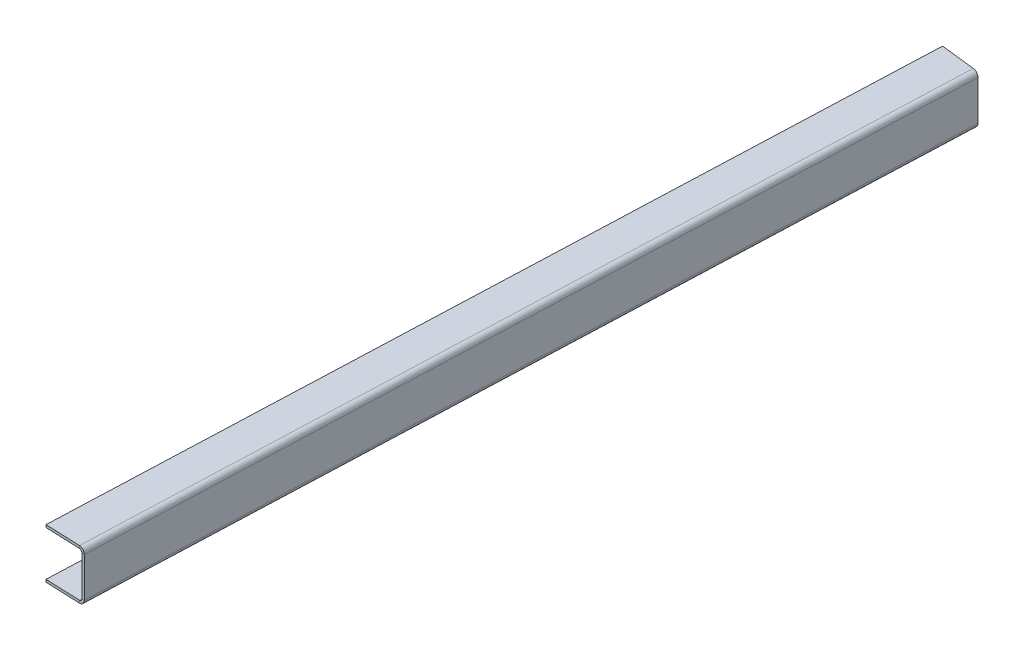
ISO-10303-21;
HEADER;
FILE_DESCRIPTION(('STEP AP214'),'2;1');
FILE_NAME('part.step','',(''),(''),'','','');
FILE_SCHEMA(('AUTOMOTIVE_DESIGN { 1 0 10303 214 1 1 1 1 }'));
ENDSEC;
DATA;
#1=APPLICATION_CONTEXT('core data for automotive mechanical design processes');
#2=APPLICATION_PROTOCOL_DEFINITION('international standard','automotive_design',2000,#1);
#3=PRODUCT_CONTEXT('',#1,'mechanical');
#4=PRODUCT('Part','Part','',(#3));
#5=PRODUCT_RELATED_PRODUCT_CATEGORY('part','',(#4));
#6=PRODUCT_DEFINITION_FORMATION('','',#4);
#7=PRODUCT_DEFINITION_CONTEXT('part definition',#1,'design');
#8=PRODUCT_DEFINITION('design','',#6,#7);
#9=PRODUCT_DEFINITION_SHAPE('','',#8);
#10=(LENGTH_UNIT() NAMED_UNIT(*) SI_UNIT(.MILLI.,.METRE.));
#11=(NAMED_UNIT(*) PLANE_ANGLE_UNIT() SI_UNIT($,.RADIAN.));
#12=(NAMED_UNIT(*) SI_UNIT($,.STERADIAN.) SOLID_ANGLE_UNIT());
#13=UNCERTAINTY_MEASURE_WITH_UNIT(LENGTH_MEASURE(1.E-05),#10,'distance_accuracy_value','');
#14=(GEOMETRIC_REPRESENTATION_CONTEXT(3) GLOBAL_UNCERTAINTY_ASSIGNED_CONTEXT((#13)) GLOBAL_UNIT_ASSIGNED_CONTEXT((#10,
#11,#12)) REPRESENTATION_CONTEXT('',''));
#15=CARTESIAN_POINT('',(0.,0.,0.));
#16=DIRECTION('',(0.,0.,1.));
#17=DIRECTION('',(1.,0.,0.));
#18=AXIS2_PLACEMENT_3D('',#15,#16,#17);
#19=CARTESIAN_POINT('',(-1086.66471952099,1.81488018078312E-13,-704.50466002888));
#20=DIRECTION('',(0.0392134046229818,0.,-0.999230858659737));
#21=DIRECTION('',(0.,1.,0.));
#22=AXIS2_PLACEMENT_3D('',#19,#20,#21);
#23=PLANE('',#22);
#24=DIRECTION('',(-0.999230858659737,0.,-0.0392134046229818));
#25=VECTOR('',#24,1.);
#26=CARTESIAN_POINT('',(-1086.66471952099,-28.4988000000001,-704.50466002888));
#27=LINE('',#26,#25);
#28=CARTESIAN_POINT('',(-1085.04036983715,-28.4988000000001,-704.440914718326));
#29=VERTEX_POINT('',#28);
#30=CARTESIAN_POINT('',(-1086.66471952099,-28.4988000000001,-704.50466002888));
#31=VERTEX_POINT('',#30);
#32=EDGE_CURVE('E12',#29,#31,#27,.T.);
#33=ORIENTED_EDGE('',*,*,#32,.F.);
#34=DIRECTION('',(0.,1.,0.));
#35=VECTOR('',#34,1.);
#36=CARTESIAN_POINT('',(-1085.04036983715,1.81162777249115E-13,-704.440914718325));
#37=LINE('',#36,#35);
#38=CARTESIAN_POINT('',(-1085.04036983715,-3.25120000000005,-704.440914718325));
#39=VERTEX_POINT('',#38);
#40=EDGE_CURVE('E137',#29,#39,#37,.T.);
#41=ORIENTED_EDGE('',*,*,#40,.T.);
#42=DIRECTION('',(-0.999230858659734,0.,-0.0392134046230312));
#43=VECTOR('',#42,1.);
#44=CARTESIAN_POINT('',(-1086.66471952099,-3.25120000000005,-704.50466002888));
#45=LINE('',#44,#43);
#46=CARTESIAN_POINT('',(-1086.66471952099,-3.25120000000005,-704.50466002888));
#47=VERTEX_POINT('',#46);
#48=EDGE_CURVE('E90',#39,#47,#45,.T.);
#49=ORIENTED_EDGE('',*,*,#48,.T.);
#50=DIRECTION('',(0.,1.,0.));
#51=VECTOR('',#50,1.);
#52=CARTESIAN_POINT('',(-1086.66471952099,1.81488018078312E-13,-704.50466002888));
#53=LINE('',#52,#51);
#54=EDGE_CURVE('E139',#31,#47,#53,.T.);
#55=ORIENTED_EDGE('',*,*,#54,.F.);
#56=EDGE_LOOP('',(#33,#41,#49,#55));
#57=FACE_BOUND('',#56,.T.);
#58=ADVANCED_FACE('F78',(#57),#23,.F.);
#59=CARTESIAN_POINT('',(-1089.91334775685,-3.25120000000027,-704.63396322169));
#60=CARTESIAN_POINT('',(-1090.45479765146,-3.25120000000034,-704.655211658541));
#61=CARTESIAN_POINT('',(-1090.99624754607,-3.25120000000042,-704.676460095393));
#62=CARTESIAN_POINT('',(-1091.53769744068,-3.25120000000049,-704.697708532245));
#63=CARTESIAN_POINT('',(-1089.91334775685,-6.50240000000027,-704.63396322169));
#64=CARTESIAN_POINT('',(-1090.45479765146,-7.58613333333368,-704.655211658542));
#65=CARTESIAN_POINT('',(-1090.99624754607,-8.66986666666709,-704.676460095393));
#66=CARTESIAN_POINT('',(-1091.53769744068,-9.75360000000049,-704.697708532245));
#67=CARTESIAN_POINT('',(-1086.66471952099,-6.50239999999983,-704.50466002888));
#68=CARTESIAN_POINT('',(-1086.12326962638,-7.58613333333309,-704.483411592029));
#69=CARTESIAN_POINT('',(-1085.58181973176,-8.66986666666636,-704.462163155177));
#70=CARTESIAN_POINT('',(-1085.04036983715,-9.75359999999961,-704.440914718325));
#71=CARTESIAN_POINT('',(-1086.66471952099,-3.25119999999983,-704.50466002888));
#72=CARTESIAN_POINT('',(-1086.12326962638,-3.25119999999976,-704.483411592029));
#73=CARTESIAN_POINT('',(-1085.58181973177,-3.25119999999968,-704.462163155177));
#74=CARTESIAN_POINT('',(-1085.04036983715,-3.25119999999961,-704.440914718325));
#75=CARTESIAN_POINT('',(-1086.66471952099,1.69569219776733E-13,-704.50466002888));
#76=CARTESIAN_POINT('',(-1086.12326962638,1.08373333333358,-704.483411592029));
#77=CARTESIAN_POINT('',(-1085.58181973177,2.16746666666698,-704.462163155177));
#78=CARTESIAN_POINT('',(-1085.04036983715,3.25120000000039,-704.440914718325));
#79=CARTESIAN_POINT('',(-1089.91334775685,-2.70183181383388E-13,-704.63396322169));
#80=CARTESIAN_POINT('',(-1090.45479765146,1.08373333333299,-704.655211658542));
#81=CARTESIAN_POINT('',(-1090.99624754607,2.16746666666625,-704.676460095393));
#82=CARTESIAN_POINT('',(-1091.53769744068,3.25119999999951,-704.697708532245));
#83=CARTESIAN_POINT('',(-1089.91334775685,-3.25120000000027,-704.63396322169));
#84=CARTESIAN_POINT('',(-1090.45479765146,-3.25120000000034,-704.655211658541));
#85=CARTESIAN_POINT('',(-1090.99624754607,-3.25120000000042,-704.676460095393));
#86=CARTESIAN_POINT('',(-1091.53769744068,-3.25120000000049,-704.697708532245));
#87=(BOUNDED_SURFACE() B_SPLINE_SURFACE(3,3,((#59,#60,#61,#62),(#63,#64,#65,#66),(#67,#68,#69,
#70),(#71,#72,#73,#74),(#75,#76,#77,#78),(#79,#80,#81,#82),(#83,#84,#85,#86)),.UNSPECIFIED.,.T.,
.F.,.F.) B_SPLINE_SURFACE_WITH_KNOTS((4,3,4),(4,4),(0.,0.5,1.),(0.,1.),
.UNSPECIFIED.) GEOMETRIC_REPRESENTATION_ITEM() RATIONAL_B_SPLINE_SURFACE(((1.,1.,1.,1.),
(0.333333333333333,0.333333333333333,0.333333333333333,0.333333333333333),(0.333333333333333,
0.333333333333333,0.333333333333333,0.333333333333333),(1.,1.,1.,1.),(0.333333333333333,
0.333333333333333,0.333333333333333,0.333333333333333),(0.333333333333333,0.333333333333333,
0.333333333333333,0.333333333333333),(1.,1.,1.,1.))) REPRESENTATION_ITEM('') SURFACE());
#88=CARTESIAN_POINT('',(-1088.28903363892,-3.25120000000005,-704.569311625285));
#89=DIRECTION('',(-0.0394921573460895,0.,0.999219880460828));
#90=DIRECTION('',(-0.999219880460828,-1.35258484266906E-13,-0.0394921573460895));
#91=AXIS2_PLACEMENT_3D('',#88,#89,#90);
#92=ELLIPSE('',#91,3.25120012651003,3.2512);
#93=CARTESIAN_POINT('',(-1088.28903363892,0.,-704.569311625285));
#94=VERTEX_POINT('',#93);
#95=EDGE_CURVE('E215',#39,#94,#92,.T.);
#96=DIRECTION('',(0.,-1.,0.));
#97=VECTOR('',#96,1.);
#98=CARTESIAN_POINT('',(-1088.28903363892,-1.62560000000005,-704.569311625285));
#99=LINE('',#98,#97);
#100=CARTESIAN_POINT('',(-1088.28903363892,-1.62560000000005,-704.569311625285));
#101=VERTEX_POINT('',#100);
#102=EDGE_CURVE('E205',#94,#101,#99,.T.);
#103=CARTESIAN_POINT('',(-1088.28903363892,-3.25120000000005,-704.569311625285));
#104=DIRECTION('',(-0.0397709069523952,0.,0.999208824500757));
#105=DIRECTION('',(-0.999208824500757,-1.35321803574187E-13,-0.0397709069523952));
#106=AXIS2_PLACEMENT_3D('',#103,#104,#105);
#107=ELLIPSE('',#106,1.62560025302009,1.6256);
#108=EDGE_CURVE('E213',#47,#101,#107,.T.);
#109=ORIENTED_EDGE('',*,*,#48,.F.);
#110=ORIENTED_EDGE('',*,*,#95,.T.);
#111=ORIENTED_EDGE('',*,*,#102,.T.);
#112=ORIENTED_EDGE('',*,*,#108,.F.);
#113=EDGE_LOOP('',(#109,#110,#111,#112));
#114=FACE_BOUND('',#113,.T.);
#115=ADVANCED_FACE('F212',(#114),#87,.F.);
#116=CARTESIAN_POINT('',(-1110.42470415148,-1.62560000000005,-705.450364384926));
#117=DIRECTION('',(-0.0397709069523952,0.,0.999208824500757));
#118=DIRECTION('',(0.999208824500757,0.,0.0397709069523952));
#119=AXIS2_PLACEMENT_3D('',#116,#117,#118);
#120=PLANE('',#119);
#121=ORIENTED_EDGE('',*,*,#102,.F.);
#122=DIRECTION('',(0.999208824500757,0.,0.0397709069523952));
#123=VECTOR('',#122,1.);
#124=CARTESIAN_POINT('',(-1110.42470415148,0.,-705.450364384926));
#125=LINE('',#124,#123);
#126=CARTESIAN_POINT('',(-1110.42470415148,0.,-705.450364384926));
#127=VERTEX_POINT('',#126);
#128=EDGE_CURVE('E176',#127,#94,#125,.T.);
#129=ORIENTED_EDGE('',*,*,#128,.F.);
#130=DIRECTION('',(0.,-1.,0.));
#131=VECTOR('',#130,1.);
#132=CARTESIAN_POINT('',(-1110.42470415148,-1.62560000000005,-705.450364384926));
#133=LINE('',#132,#131);
#134=CARTESIAN_POINT('',(-1110.42470415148,-1.62560000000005,-705.450364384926));
#135=VERTEX_POINT('',#134);
#136=EDGE_CURVE('E202',#127,#135,#133,.T.);
#137=ORIENTED_EDGE('',*,*,#136,.T.);
#138=DIRECTION('',(0.999208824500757,0.,0.0397709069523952));
#139=VECTOR('',#138,1.);
#140=CARTESIAN_POINT('',(-1110.42470415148,-1.62560000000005,-705.450364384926));
#141=LINE('',#140,#139);
#142=EDGE_CURVE('E232',#135,#101,#141,.T.);
#143=ORIENTED_EDGE('',*,*,#142,.T.);
#144=EDGE_LOOP('',(#121,#129,#137,#143));
#145=FACE_BOUND('',#144,.T.);
#146=ADVANCED_FACE('F233',(#145),#120,.T.);
#147=CARTESIAN_POINT('',(-1088.88483177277,-1.62560000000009,-1254.32658105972));
#148=DIRECTION('',(-0.999230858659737,0.,-0.0392134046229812));
#149=DIRECTION('',(-0.0392134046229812,0.,0.999230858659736));
#150=AXIS2_PLACEMENT_3D('',#147,#148,#149);
#151=PLANE('',#150);
#152=ORIENTED_EDGE('',*,*,#136,.F.);
#153=DIRECTION('',(-0.0392134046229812,0.,0.999230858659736));
#154=VECTOR('',#153,1.);
#155=CARTESIAN_POINT('',(-1088.88483177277,0.,-1254.32658105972));
#156=LINE('',#155,#154);
#157=CARTESIAN_POINT('',(-1088.88483177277,0.,-1254.32658105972));
#158=VERTEX_POINT('',#157);
#159=EDGE_CURVE('E168',#158,#127,#156,.T.);
#160=ORIENTED_EDGE('',*,*,#159,.F.);
#161=DIRECTION('',(0.,-1.,0.));
#162=VECTOR('',#161,1.);
#163=CARTESIAN_POINT('',(-1088.88483177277,-1.62560000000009,-1254.32658105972));
#164=LINE('',#163,#162);
#165=CARTESIAN_POINT('',(-1088.88483177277,-1.62560000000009,-1254.32658105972));
#166=VERTEX_POINT('',#165);
#167=EDGE_CURVE('E199',#158,#166,#164,.T.);
#168=ORIENTED_EDGE('',*,*,#167,.T.);
#169=DIRECTION('',(-0.0392134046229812,0.,0.999230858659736));
#170=VECTOR('',#169,1.);
#171=CARTESIAN_POINT('',(-1088.88483177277,-1.62560000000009,-1254.32658105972));
#172=LINE('',#171,#170);
#173=EDGE_CURVE('E237',#166,#135,#172,.T.);
#174=ORIENTED_EDGE('',*,*,#173,.T.);
#175=EDGE_LOOP('',(#152,#160,#168,#174));
#176=FACE_BOUND('',#175,.T.);
#177=ADVANCED_FACE('F280',(#176),#151,.T.);
#178=CARTESIAN_POINT('',(-1063.57775084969,-1.62560000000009,-1251.46062743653));
#179=DIRECTION('',(0.112527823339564,0.,-0.993648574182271));
#180=DIRECTION('',(-0.993648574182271,0.,-0.112527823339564));
#181=AXIS2_PLACEMENT_3D('',#178,#179,#180);
#182=PLANE('',#181);
#183=ORIENTED_EDGE('',*,*,#167,.F.);
#184=DIRECTION('',(-0.993648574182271,0.,-0.112527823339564));
#185=VECTOR('',#184,1.);
#186=CARTESIAN_POINT('',(-1063.57775084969,0.,-1251.46062743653));
#187=LINE('',#186,#185);
#188=CARTESIAN_POINT('',(-1066.81267915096,0.,-1251.82697369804));
#189=VERTEX_POINT('',#188);
#190=EDGE_CURVE('E173',#189,#158,#187,.T.);
#191=ORIENTED_EDGE('',*,*,#190,.F.);
#192=DIRECTION('',(1.0244429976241E-13,-1.,0.));
#193=VECTOR('',#192,1.);
#194=CARTESIAN_POINT('',(-1066.81267915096,-1.62560000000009,-1251.82697369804));
#195=LINE('',#194,#193);
#196=CARTESIAN_POINT('',(-1066.81267915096,-1.62560000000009,-1251.82697369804));
#197=VERTEX_POINT('',#196);
#198=EDGE_CURVE('E196',#189,#197,#195,.T.);
#199=ORIENTED_EDGE('',*,*,#198,.T.);
#200=DIRECTION('',(-0.993648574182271,0.,-0.112527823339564));
#201=VECTOR('',#200,1.);
#202=CARTESIAN_POINT('',(-1063.57775084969,-1.62560000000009,-1251.46062743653));
#203=LINE('',#202,#201);
#204=EDGE_CURVE('E238',#197,#166,#203,.T.);
#205=ORIENTED_EDGE('',*,*,#204,.T.);
#206=EDGE_LOOP('',(#183,#191,#199,#205));
#207=FACE_BOUND('',#206,.T.);
#208=ADVANCED_FACE('F307',(#207),#182,.T.);
#209=CARTESIAN_POINT('',(-1068.43233233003,-3.25120000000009,-1252.01039472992));
#210=CARTESIAN_POINT('',(-1068.97378222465,-3.25120000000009,-1252.03164316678));
#211=CARTESIAN_POINT('',(-1069.51523211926,-3.25120000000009,-1252.05289160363));
#212=CARTESIAN_POINT('',(-1070.05668201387,-3.25120000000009,-1252.07414004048));
#213=CARTESIAN_POINT('',(-1068.43233233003,0.,-1252.01039472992));
#214=CARTESIAN_POINT('',(-1068.97378222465,1.08373333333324,-1252.03164316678));
#215=CARTESIAN_POINT('',(-1069.51523211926,2.16746666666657,-1252.05289160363));
#216=CARTESIAN_POINT('',(-1070.05668201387,3.25119999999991,-1252.07414004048));
#217=CARTESIAN_POINT('',(-1065.19302597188,0.,-1251.64355266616));
#218=CARTESIAN_POINT('',(-1064.65157607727,1.08373333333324,-1251.6223042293));
#219=CARTESIAN_POINT('',(-1064.11012618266,2.16746666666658,-1251.60105579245));
#220=CARTESIAN_POINT('',(-1063.56867628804,3.25119999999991,-1251.5798073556));
#221=CARTESIAN_POINT('',(-1065.19302597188,-3.25120000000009,-1251.64355266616));
#222=CARTESIAN_POINT('',(-1064.65157607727,-3.25120000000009,-1251.6223042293));
#223=CARTESIAN_POINT('',(-1064.11012618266,-3.25120000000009,-1251.60105579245));
#224=CARTESIAN_POINT('',(-1063.56867628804,-3.25120000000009,-1251.5798073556));
#225=CARTESIAN_POINT('',(-1065.19302597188,-6.50240000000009,-1251.64355266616));
#226=CARTESIAN_POINT('',(-1064.65157607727,-7.58613333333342,-1251.6223042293));
#227=CARTESIAN_POINT('',(-1064.11012618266,-8.66986666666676,-1251.60105579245));
#228=CARTESIAN_POINT('',(-1063.56867628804,-9.75360000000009,-1251.5798073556));
#229=CARTESIAN_POINT('',(-1068.43233233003,-6.50240000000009,-1252.01039472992));
#230=CARTESIAN_POINT('',(-1068.97378222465,-7.58613333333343,-1252.03164316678));
#231=CARTESIAN_POINT('',(-1069.51523211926,-8.66986666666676,-1252.05289160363));
#232=CARTESIAN_POINT('',(-1070.05668201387,-9.75360000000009,-1252.07414004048));
#233=CARTESIAN_POINT('',(-1068.43233233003,-3.25120000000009,-1252.01039472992));
#234=CARTESIAN_POINT('',(-1068.97378222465,-3.25120000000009,-1252.03164316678));
#235=CARTESIAN_POINT('',(-1069.51523211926,-3.25120000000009,-1252.05289160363));
#236=CARTESIAN_POINT('',(-1070.05668201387,-3.25120000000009,-1252.07414004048));
#237=(BOUNDED_SURFACE() B_SPLINE_SURFACE(3,3,((#209,#210,#211,#212),(#213,#214,#215,#216),(#217,
#218,#219,#220),(#221,#222,#223,#224),(#225,#226,#227,#228),(#229,#230,#231,#232),(#233,#234,
#235,#236)),.UNSPECIFIED.,.T.,.F.,.F.) B_SPLINE_SURFACE_WITH_KNOTS((4,3,4),(4,4),(0.,0.5,1.),
(0.,1.),.UNSPECIFIED.) GEOMETRIC_REPRESENTATION_ITEM() RATIONAL_B_SPLINE_SURFACE(((1.,1.,1.,1.),
(0.333333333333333,0.333333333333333,0.333333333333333,0.333333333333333),(0.333333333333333,
0.333333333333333,0.333333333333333,0.333333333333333),(1.,1.,1.,1.),(0.333333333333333,
0.333333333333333,0.333333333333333,0.333333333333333),(0.333333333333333,0.333333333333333,
0.333333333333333,0.333333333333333),(1.,1.,1.,1.))) REPRESENTATION_ITEM('') SURFACE());
#238=CARTESIAN_POINT('',(-1066.81267915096,-3.25120000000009,-1251.82697369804));
#239=DIRECTION('',(0.075971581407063,0.,-0.997109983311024));
#240=DIRECTION('',(-0.997109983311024,0.,-0.075971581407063));
#241=AXIS2_PLACEMENT_3D('',#238,#239,#240);
#242=ELLIPSE('',#241,3.2534052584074,3.2512);
#243=CARTESIAN_POINT('',(-1063.56867628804,-3.25120000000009,-1251.5798073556));
#244=VERTEX_POINT('',#243);
#245=EDGE_CURVE('E178',#189,#244,#242,.T.);
#246=DIRECTION('',(-0.999230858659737,0.,-0.0392134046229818));
#247=VECTOR('',#246,1.);
#248=CARTESIAN_POINT('',(-1065.19302597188,-3.25120000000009,-1251.64355266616));
#249=LINE('',#248,#247);
#250=CARTESIAN_POINT('',(-1065.19302597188,-3.25120000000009,-1251.64355266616));
#251=VERTEX_POINT('',#250);
#252=EDGE_CURVE('E194',#244,#251,#249,.T.);
#253=CARTESIAN_POINT('',(-1066.81267915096,-3.25120000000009,-1251.82697369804));
#254=DIRECTION('',(0.112527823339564,0.,-0.993648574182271));
#255=DIRECTION('',(-0.993648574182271,0.,-0.112527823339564));
#256=AXIS2_PLACEMENT_3D('',#253,#254,#255);
#257=ELLIPSE('',#256,1.63000604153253,1.6256);
#258=EDGE_CURVE('E229',#197,#251,#257,.T.);
#259=ORIENTED_EDGE('',*,*,#198,.F.);
#260=ORIENTED_EDGE('',*,*,#245,.T.);
#261=ORIENTED_EDGE('',*,*,#252,.T.);
#262=ORIENTED_EDGE('',*,*,#258,.F.);
#263=EDGE_LOOP('',(#259,#260,#261,#262));
#264=FACE_BOUND('',#263,.T.);
#265=ADVANCED_FACE('F357',(#264),#237,.F.);
#266=CARTESIAN_POINT('',(-1065.19302597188,1.96636371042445E-13,-1251.64355266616));
#267=DIRECTION('',(-0.0392134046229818,0.,0.999230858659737));
#268=DIRECTION('',(0.,-1.,0.));
#269=AXIS2_PLACEMENT_3D('',#266,#267,#268);
#270=PLANE('',#269);
#271=ORIENTED_EDGE('',*,*,#252,.F.);
#272=DIRECTION('',(0.,1.,0.));
#273=VECTOR('',#272,1.);
#274=CARTESIAN_POINT('',(-1063.56867628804,1.81162777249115E-13,-1251.5798073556));
#275=LINE('',#274,#273);
#276=CARTESIAN_POINT('',(-1063.56867628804,-28.4988000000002,-1251.5798073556));
#277=VERTEX_POINT('',#276);
#278=EDGE_CURVE('E167',#244,#277,#275,.F.);
#279=ORIENTED_EDGE('',*,*,#278,.T.);
#280=DIRECTION('',(-0.999230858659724,0.,-0.0392134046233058));
#281=VECTOR('',#280,1.);
#282=CARTESIAN_POINT('',(-1065.19302597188,-28.4988000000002,-1251.64355266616));
#283=LINE('',#282,#281);
#284=CARTESIAN_POINT('',(-1065.19302597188,-28.4988000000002,-1251.64355266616));
#285=VERTEX_POINT('',#284);
#286=EDGE_CURVE('E191',#277,#285,#283,.T.);
#287=ORIENTED_EDGE('',*,*,#286,.T.);
#288=DIRECTION('',(0.,-1.,0.));
#289=VECTOR('',#288,1.);
#290=CARTESIAN_POINT('',(-1065.19302597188,1.96636371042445E-13,-1251.64355266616));
#291=LINE('',#290,#289);
#292=EDGE_CURVE('E284',#251,#285,#291,.T.);
#293=ORIENTED_EDGE('',*,*,#292,.F.);
#294=EDGE_LOOP('',(#271,#279,#287,#293));
#295=FACE_BOUND('',#294,.T.);
#296=ADVANCED_FACE('F322',(#295),#270,.F.);
#297=CARTESIAN_POINT('',(-1065.19302597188,-28.4988000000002,-1251.64355266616));
#298=CARTESIAN_POINT('',(-1064.65157607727,-28.4988000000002,-1251.6223042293));
#299=CARTESIAN_POINT('',(-1064.11012618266,-28.4988000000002,-1251.60105579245));
#300=CARTESIAN_POINT('',(-1063.56867628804,-28.4988000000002,-1251.5798073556));
#301=CARTESIAN_POINT('',(-1065.19302597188,-31.7500000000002,-1251.64355266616));
#302=CARTESIAN_POINT('',(-1064.65157607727,-32.8337333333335,-1251.6223042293));
#303=CARTESIAN_POINT('',(-1064.11012618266,-33.9174666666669,-1251.60105579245));
#304=CARTESIAN_POINT('',(-1063.56867628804,-35.0012000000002,-1251.5798073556));
#305=CARTESIAN_POINT('',(-1068.43233233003,-31.7500000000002,-1252.01039472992));
#306=CARTESIAN_POINT('',(-1068.97378222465,-32.8337333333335,-1252.03164316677));
#307=CARTESIAN_POINT('',(-1069.51523211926,-33.9174666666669,-1252.05289160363));
#308=CARTESIAN_POINT('',(-1070.05668201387,-35.0012000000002,-1252.07414004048));
#309=CARTESIAN_POINT('',(-1068.43233233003,-28.4988000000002,-1252.01039472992));
#310=CARTESIAN_POINT('',(-1068.97378222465,-28.4988000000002,-1252.03164316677));
#311=CARTESIAN_POINT('',(-1069.51523211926,-28.4988000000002,-1252.05289160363));
#312=CARTESIAN_POINT('',(-1070.05668201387,-28.4988000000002,-1252.07414004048));
#313=CARTESIAN_POINT('',(-1068.43233233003,-25.2476000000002,-1252.01039472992));
#314=CARTESIAN_POINT('',(-1068.97378222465,-24.1638666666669,-1252.03164316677));
#315=CARTESIAN_POINT('',(-1069.51523211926,-23.0801333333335,-1252.05289160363));
#316=CARTESIAN_POINT('',(-1070.05668201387,-21.9964000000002,-1252.07414004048));
#317=CARTESIAN_POINT('',(-1065.19302597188,-25.2476000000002,-1251.64355266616));
#318=CARTESIAN_POINT('',(-1064.65157607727,-24.1638666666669,-1251.6223042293));
#319=CARTESIAN_POINT('',(-1064.11012618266,-23.0801333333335,-1251.60105579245));
#320=CARTESIAN_POINT('',(-1063.56867628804,-21.9964000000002,-1251.5798073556));
#321=CARTESIAN_POINT('',(-1065.19302597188,-28.4988000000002,-1251.64355266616));
#322=CARTESIAN_POINT('',(-1064.65157607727,-28.4988000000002,-1251.6223042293));
#323=CARTESIAN_POINT('',(-1064.11012618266,-28.4988000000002,-1251.60105579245));
#324=CARTESIAN_POINT('',(-1063.56867628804,-28.4988000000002,-1251.5798073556));
#325=(BOUNDED_SURFACE() B_SPLINE_SURFACE(3,3,((#297,#298,#299,#300),(#301,#302,#303,#304),(#305,
#306,#307,#308),(#309,#310,#311,#312),(#313,#314,#315,#316),(#317,#318,#319,#320),(#321,#322,
#323,#324)),.UNSPECIFIED.,.T.,.F.,.F.) B_SPLINE_SURFACE_WITH_KNOTS((4,3,4),(4,4),(0.,0.5,1.),
(0.,1.),.UNSPECIFIED.) GEOMETRIC_REPRESENTATION_ITEM() RATIONAL_B_SPLINE_SURFACE(((1.,1.,1.,1.),
(0.333333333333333,0.333333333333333,0.333333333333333,0.333333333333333),(0.333333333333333,
0.333333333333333,0.333333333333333,0.333333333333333),(1.,1.,1.,1.),(0.333333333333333,
0.333333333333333,0.333333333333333,0.333333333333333),(0.333333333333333,0.333333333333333,
0.333333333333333,0.333333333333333),(1.,1.,1.,1.))) REPRESENTATION_ITEM('') SURFACE());
#326=CARTESIAN_POINT('',(-1066.81267915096,-28.4988000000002,-1251.82697369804));
#327=DIRECTION('',(0.0759715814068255,0.,-0.997109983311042));
#328=DIRECTION('',(0.997109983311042,0.,0.0759715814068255));
#329=AXIS2_PLACEMENT_3D('',#326,#327,#328);
#330=ELLIPSE('',#329,3.25340525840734,3.2512);
#331=CARTESIAN_POINT('',(-1066.81267915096,-31.7500000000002,-1251.82697369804));
#332=VERTEX_POINT('',#331);
#333=EDGE_CURVE('E155',#277,#332,#330,.T.);
#334=DIRECTION('',(0.,1.,0.));
#335=VECTOR('',#334,1.);
#336=CARTESIAN_POINT('',(-1066.81267915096,-30.1244000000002,-1251.82697369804));
#337=LINE('',#336,#335);
#338=CARTESIAN_POINT('',(-1066.81267915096,-30.1244000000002,-1251.82697369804));
#339=VERTEX_POINT('',#338);
#340=EDGE_CURVE('E188',#332,#339,#337,.T.);
#341=CARTESIAN_POINT('',(-1066.81267915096,-28.4988000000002,-1251.82697369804));
#342=DIRECTION('',(0.112527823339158,0.,-0.993648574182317));
#343=DIRECTION('',(0.993648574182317,0.,0.112527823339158));
#344=AXIS2_PLACEMENT_3D('',#341,#342,#343);
#345=ELLIPSE('',#344,1.63000604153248,1.6256);
#346=EDGE_CURVE('E254',#285,#339,#345,.T.);
#347=ORIENTED_EDGE('',*,*,#286,.F.);
#348=ORIENTED_EDGE('',*,*,#333,.T.);
#349=ORIENTED_EDGE('',*,*,#340,.T.);
#350=ORIENTED_EDGE('',*,*,#346,.F.);
#351=EDGE_LOOP('',(#347,#348,#349,#350));
#352=FACE_BOUND('',#351,.T.);
#353=ADVANCED_FACE('F326',(#352),#325,.F.);
#354=CARTESIAN_POINT('',(-1088.88483177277,-30.1244000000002,-1254.32658105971));
#355=DIRECTION('',(0.112527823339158,0.,-0.993648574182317));
#356=DIRECTION('',(0.993648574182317,0.,0.112527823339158));
#357=AXIS2_PLACEMENT_3D('',#354,#355,#356);
#358=PLANE('',#357);
#359=ORIENTED_EDGE('',*,*,#340,.F.);
#360=DIRECTION('',(0.993648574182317,0.,0.112527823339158));
#361=VECTOR('',#360,1.);
#362=CARTESIAN_POINT('',(-1088.88483177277,-31.7500000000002,-1254.32658105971));
#363=LINE('',#362,#361);
#364=CARTESIAN_POINT('',(-1088.88483177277,-31.7500000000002,-1254.32658105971));
#365=VERTEX_POINT('',#364);
#366=EDGE_CURVE('E262',#365,#332,#363,.T.);
#367=ORIENTED_EDGE('',*,*,#366,.F.);
#368=DIRECTION('',(0.,1.,0.));
#369=VECTOR('',#368,1.);
#370=CARTESIAN_POINT('',(-1088.88483177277,-30.1244000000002,-1254.32658105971));
#371=LINE('',#370,#369);
#372=CARTESIAN_POINT('',(-1088.88483177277,-30.1244000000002,-1254.32658105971));
#373=VERTEX_POINT('',#372);
#374=EDGE_CURVE('E185',#365,#373,#371,.T.);
#375=ORIENTED_EDGE('',*,*,#374,.T.);
#376=DIRECTION('',(0.993648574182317,0.,0.112527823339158));
#377=VECTOR('',#376,1.);
#378=CARTESIAN_POINT('',(-1088.88483177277,-30.1244000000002,-1254.32658105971));
#379=LINE('',#378,#377);
#380=EDGE_CURVE('E293',#373,#339,#379,.T.);
#381=ORIENTED_EDGE('',*,*,#380,.T.);
#382=EDGE_LOOP('',(#359,#367,#375,#381));
#383=FACE_BOUND('',#382,.T.);
#384=ADVANCED_FACE('F374',(#383),#358,.T.);
#385=CARTESIAN_POINT('',(-1110.42470415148,-30.1244000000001,-705.450364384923));
#386=DIRECTION('',(-0.999230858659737,0.,-0.0392134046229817));
#387=DIRECTION('',(0.0392134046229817,0.,-0.999230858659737));
#388=AXIS2_PLACEMENT_3D('',#385,#386,#387);
#389=PLANE('',#388);
#390=ORIENTED_EDGE('',*,*,#374,.F.);
#391=DIRECTION('',(0.0392134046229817,0.,-0.999230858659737));
#392=VECTOR('',#391,1.);
#393=CARTESIAN_POINT('',(-1110.42470415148,-31.7500000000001,-705.450364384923));
#394=LINE('',#393,#392);
#395=CARTESIAN_POINT('',(-1110.42470415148,-31.7500000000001,-705.450364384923));
#396=VERTEX_POINT('',#395);
#397=EDGE_CURVE('E255',#396,#365,#394,.T.);
#398=ORIENTED_EDGE('',*,*,#397,.F.);
#399=DIRECTION('',(0.,1.,0.));
#400=VECTOR('',#399,1.);
#401=CARTESIAN_POINT('',(-1110.42470415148,-30.1244000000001,-705.450364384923));
#402=LINE('',#401,#400);
#403=CARTESIAN_POINT('',(-1110.42470415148,-30.1244000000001,-705.450364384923));
#404=VERTEX_POINT('',#403);
#405=EDGE_CURVE('E182',#396,#404,#402,.T.);
#406=ORIENTED_EDGE('',*,*,#405,.T.);
#407=DIRECTION('',(0.0392134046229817,0.,-0.999230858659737));
#408=VECTOR('',#407,1.);
#409=CARTESIAN_POINT('',(-1110.42470415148,-30.1244000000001,-705.450364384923));
#410=LINE('',#409,#408);
#411=EDGE_CURVE('E296',#404,#373,#410,.T.);
#412=ORIENTED_EDGE('',*,*,#411,.T.);
#413=EDGE_LOOP('',(#390,#398,#406,#412));
#414=FACE_BOUND('',#413,.T.);
#415=ADVANCED_FACE('F382',(#414),#389,.T.);
#416=CARTESIAN_POINT('',(-1085.04479605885,-30.1244000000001,-704.440183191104));
#417=DIRECTION('',(-0.0397709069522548,0.,0.999208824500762));
#418=DIRECTION('',(-0.999208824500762,0.,-0.0397709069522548));
#419=AXIS2_PLACEMENT_3D('',#416,#417,#418);
#420=PLANE('',#419);
#421=ORIENTED_EDGE('',*,*,#405,.F.);
#422=DIRECTION('',(-0.999208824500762,0.,-0.0397709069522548));
#423=VECTOR('',#422,1.);
#424=CARTESIAN_POINT('',(-1085.04479605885,-31.7500000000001,-704.440183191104));
#425=LINE('',#424,#423);
#426=CARTESIAN_POINT('',(-1088.28903363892,-31.7500000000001,-704.569311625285));
#427=VERTEX_POINT('',#426);
#428=EDGE_CURVE('E259',#427,#396,#425,.T.);
#429=ORIENTED_EDGE('',*,*,#428,.F.);
#430=DIRECTION('',(0.,1.,-1.36592399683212E-13));
#431=VECTOR('',#430,1.);
#432=CARTESIAN_POINT('',(-1088.28903363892,-30.1244000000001,-704.569311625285));
#433=LINE('',#432,#431);
#434=CARTESIAN_POINT('',(-1088.28903363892,-30.1244000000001,-704.569311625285));
#435=VERTEX_POINT('',#434);
#436=EDGE_CURVE('E84',#427,#435,#433,.T.);
#437=ORIENTED_EDGE('',*,*,#436,.T.);
#438=DIRECTION('',(-0.999208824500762,0.,-0.0397709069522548));
#439=VECTOR('',#438,1.);
#440=CARTESIAN_POINT('',(-1085.04479605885,-30.1244000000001,-704.440183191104));
#441=LINE('',#440,#439);
#442=EDGE_CURVE('E290',#435,#404,#441,.T.);
#443=ORIENTED_EDGE('',*,*,#442,.T.);
#444=EDGE_LOOP('',(#421,#429,#437,#443));
#445=FACE_BOUND('',#444,.T.);
#446=ADVANCED_FACE('F386',(#445),#420,.T.);
#447=CARTESIAN_POINT('',(-1086.66471952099,-28.4987999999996,-704.50466002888));
#448=CARTESIAN_POINT('',(-1086.12326962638,-28.4987999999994,-704.483411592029));
#449=CARTESIAN_POINT('',(-1085.58181973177,-28.4987999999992,-704.462163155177));
#450=CARTESIAN_POINT('',(-1085.04036983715,-28.4987999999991,-704.440914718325));
#451=CARTESIAN_POINT('',(-1086.66471952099,-25.2475999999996,-704.50466002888));
#452=CARTESIAN_POINT('',(-1086.12326962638,-24.1638666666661,-704.483411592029));
#453=CARTESIAN_POINT('',(-1085.58181973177,-23.0801333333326,-704.462163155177));
#454=CARTESIAN_POINT('',(-1085.04036983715,-21.9963999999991,-704.440914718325));
#455=CARTESIAN_POINT('',(-1089.91334775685,-25.2476000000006,-704.633963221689));
#456=CARTESIAN_POINT('',(-1090.45479765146,-24.1638666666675,-704.655211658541));
#457=CARTESIAN_POINT('',(-1090.99624754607,-23.0801333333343,-704.676460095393));
#458=CARTESIAN_POINT('',(-1091.53769744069,-21.9964000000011,-704.697708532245));
#459=CARTESIAN_POINT('',(-1089.91334775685,-28.4988000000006,-704.633963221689));
#460=CARTESIAN_POINT('',(-1090.45479765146,-28.4988000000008,-704.655211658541));
#461=CARTESIAN_POINT('',(-1090.99624754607,-28.498800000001,-704.676460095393));
#462=CARTESIAN_POINT('',(-1091.53769744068,-28.4988000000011,-704.697708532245));
#463=CARTESIAN_POINT('',(-1089.91334775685,-31.7500000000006,-704.633963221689));
#464=CARTESIAN_POINT('',(-1090.45479765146,-32.8337333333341,-704.655211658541));
#465=CARTESIAN_POINT('',(-1090.99624754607,-33.9174666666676,-704.676460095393));
#466=CARTESIAN_POINT('',(-1091.53769744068,-35.0012000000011,-704.697708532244));
#467=CARTESIAN_POINT('',(-1086.66471952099,-31.7499999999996,-704.50466002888));
#468=CARTESIAN_POINT('',(-1086.12326962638,-32.8337333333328,-704.483411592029));
#469=CARTESIAN_POINT('',(-1085.58181973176,-33.9174666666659,-704.462163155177));
#470=CARTESIAN_POINT('',(-1085.04036983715,-35.0011999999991,-704.440914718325));
#471=CARTESIAN_POINT('',(-1086.66471952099,-28.4987999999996,-704.50466002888));
#472=CARTESIAN_POINT('',(-1086.12326962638,-28.4987999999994,-704.483411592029));
#473=CARTESIAN_POINT('',(-1085.58181973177,-28.4987999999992,-704.462163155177));
#474=CARTESIAN_POINT('',(-1085.04036983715,-28.4987999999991,-704.440914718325));
#475=(BOUNDED_SURFACE() B_SPLINE_SURFACE(3,3,((#447,#448,#449,#450),(#451,#452,#453,#454),(#455,
#456,#457,#458),(#459,#460,#461,#462),(#463,#464,#465,#466),(#467,#468,#469,#470),(#471,#472,
#473,#474)),.UNSPECIFIED.,.T.,.F.,.F.) B_SPLINE_SURFACE_WITH_KNOTS((4,3,4),(4,4),(0.,0.5,1.),
(0.,1.),.UNSPECIFIED.) GEOMETRIC_REPRESENTATION_ITEM() RATIONAL_B_SPLINE_SURFACE(((1.,1.,1.,1.),
(0.333333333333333,0.333333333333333,0.333333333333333,0.333333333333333),(0.333333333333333,
0.333333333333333,0.333333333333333,0.333333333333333),(1.,1.,1.,1.),(0.333333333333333,
0.333333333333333,0.333333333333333,0.333333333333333),(0.333333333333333,0.333333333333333,
0.333333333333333,0.333333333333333),(1.,1.,1.,1.))) REPRESENTATION_ITEM('') SURFACE());
#476=CARTESIAN_POINT('',(-1088.28903363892,-28.4988000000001,-704.569311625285));
#477=DIRECTION('',(-0.0394921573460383,0.,0.99921988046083));
#478=DIRECTION('',(0.99921988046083,3.18004168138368E-13,0.0394921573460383));
#479=AXIS2_PLACEMENT_3D('',#476,#477,#478);
#480=ELLIPSE('',#479,3.25120012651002,3.2512);
#481=EDGE_CURVE('E152',#427,#29,#480,.T.);
#482=CARTESIAN_POINT('',(-1088.28903363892,-28.4988000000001,-704.569311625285));
#483=DIRECTION('',(-0.0397709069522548,0.,0.999208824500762));
#484=DIRECTION('',(0.999208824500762,3.180496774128E-13,0.0397709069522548));
#485=AXIS2_PLACEMENT_3D('',#482,#483,#484);
#486=ELLIPSE('',#485,1.62560025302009,1.6256);
#487=EDGE_CURVE('E250',#435,#31,#486,.T.);
#488=ORIENTED_EDGE('',*,*,#481,.T.);
#489=ORIENTED_EDGE('',*,*,#32,.T.);
#490=ORIENTED_EDGE('',*,*,#487,.F.);
#491=ORIENTED_EDGE('',*,*,#436,.F.);
#492=EDGE_LOOP('',(#488,#489,#490,#491));
#493=FACE_BOUND('',#492,.T.);
#494=ADVANCED_FACE('F80',(#493),#475,.F.);
#495=CARTESIAN_POINT('',(0.,-30.1244,0.));
#496=DIRECTION('',(0.,-1.,0.));
#497=DIRECTION('',(0.,0.,-1.));
#498=AXIS2_PLACEMENT_3D('',#495,#496,#497);
#499=PLANE('',#498);
#500=ORIENTED_EDGE('',*,*,#442,.F.);
#501=DIRECTION('',(0.0392134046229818,0.,-0.999230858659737));
#502=VECTOR('',#501,1.);
#503=CARTESIAN_POINT('',(-1066.81737565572,-30.1244000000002,-1251.70729797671));
#504=LINE('',#503,#502);
#505=EDGE_CURVE('E247',#435,#339,#504,.T.);
#506=ORIENTED_EDGE('',*,*,#505,.T.);
#507=ORIENTED_EDGE('',*,*,#380,.F.);
#508=ORIENTED_EDGE('',*,*,#411,.F.);
#509=EDGE_LOOP('',(#500,#506,#507,#508));
#510=FACE_BOUND('',#509,.T.);
#511=ADVANCED_FACE('F411',(#510),#499,.F.);
#512=CARTESIAN_POINT('',(-1112.59620091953,1.81427854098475E-13,-43.7220354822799));
#513=DIRECTION('',(0.999230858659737,0.,0.0392134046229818));
#514=DIRECTION('',(0.0392134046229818,0.,-0.999230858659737));
#515=AXIS2_PLACEMENT_3D('',#512,#513,#514);
#516=PLANE('',#515);
#517=ORIENTED_EDGE('',*,*,#54,.T.);
#518=DIRECTION('',(-0.0392134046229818,0.,0.999230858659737));
#519=VECTOR('',#518,1.);
#520=CARTESIAN_POINT('',(-1065.19302597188,-3.25120000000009,-1251.64355266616));
#521=LINE('',#520,#519);
#522=EDGE_CURVE('E228',#47,#251,#521,.F.);
#523=ORIENTED_EDGE('',*,*,#522,.T.);
#524=ORIENTED_EDGE('',*,*,#292,.T.);
#525=DIRECTION('',(0.0392134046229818,0.,-0.999230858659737));
#526=VECTOR('',#525,1.);
#527=CARTESIAN_POINT('',(-1086.66471952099,-28.4988000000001,-704.504660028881));
#528=LINE('',#527,#526);
#529=EDGE_CURVE('E244',#285,#31,#528,.F.);
#530=ORIENTED_EDGE('',*,*,#529,.T.);
#531=EDGE_LOOP('',(#517,#523,#524,#530));
#532=FACE_BOUND('',#531,.T.);
#533=ADVANCED_FACE('F325',(#532),#516,.F.);
#534=CARTESIAN_POINT('',(0.,-1.6256,0.));
#535=DIRECTION('',(0.,1.,0.));
#536=DIRECTION('',(0.,0.,1.));
#537=AXIS2_PLACEMENT_3D('',#534,#535,#536);
#538=PLANE('',#537);
#539=ORIENTED_EDGE('',*,*,#204,.F.);
#540=DIRECTION('',(-0.0392134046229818,0.,0.999230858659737));
#541=VECTOR('',#540,1.);
#542=CARTESIAN_POINT('',(-1088.28906920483,-1.62560000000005,-704.568405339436));
#543=LINE('',#542,#541);
#544=EDGE_CURVE('E226',#197,#101,#543,.T.);
#545=ORIENTED_EDGE('',*,*,#544,.T.);
#546=ORIENTED_EDGE('',*,*,#142,.F.);
#547=ORIENTED_EDGE('',*,*,#173,.F.);
#548=EDGE_LOOP('',(#539,#545,#546,#547));
#549=FACE_BOUND('',#548,.T.);
#550=ADVANCED_FACE('F241',(#549),#538,.F.);
#551=CARTESIAN_POINT('',(-1114.22289250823,-28.4988,-43.7261046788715));
#552=DIRECTION('',(-0.0392134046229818,0.,0.999230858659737));
#553=DIRECTION('',(0.999230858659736,0.,0.0392134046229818));
#554=AXIS2_PLACEMENT_3D('',#551,#552,#553);
#555=CYLINDRICAL_SURFACE('',#554,1.6256);
#556=ORIENTED_EDGE('',*,*,#487,.T.);
#557=ORIENTED_EDGE('',*,*,#529,.F.);
#558=ORIENTED_EDGE('',*,*,#346,.T.);
#559=ORIENTED_EDGE('',*,*,#505,.F.);
#560=EDGE_LOOP('',(#556,#557,#558,#559));
#561=FACE_BOUND('',#560,.T.);
#562=ADVANCED_FACE('F327',(#561),#555,.F.);
#563=CARTESIAN_POINT('',(-1114.22289250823,-3.2512,-43.7261046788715));
#564=DIRECTION('',(0.0392134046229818,0.,-0.999230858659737));
#565=DIRECTION('',(-0.999230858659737,0.,-0.0392134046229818));
#566=AXIS2_PLACEMENT_3D('',#563,#564,#565);
#567=CYLINDRICAL_SURFACE('',#566,1.6256);
#568=ORIENTED_EDGE('',*,*,#258,.T.);
#569=ORIENTED_EDGE('',*,*,#522,.F.);
#570=ORIENTED_EDGE('',*,*,#108,.T.);
#571=ORIENTED_EDGE('',*,*,#544,.F.);
#572=EDGE_LOOP('',(#568,#569,#570,#571));
#573=FACE_BOUND('',#572,.T.);
#574=ADVANCED_FACE('F224',(#573),#567,.F.);
#575=CARTESIAN_POINT('',(0.,-31.75,0.));
#576=DIRECTION('',(0.,-1.,0.));
#577=DIRECTION('',(0.,0.,-1.));
#578=AXIS2_PLACEMENT_3D('',#575,#576,#577);
#579=PLANE('',#578);
#580=ORIENTED_EDGE('',*,*,#428,.T.);
#581=ORIENTED_EDGE('',*,*,#397,.T.);
#582=ORIENTED_EDGE('',*,*,#366,.T.);
#583=DIRECTION('',(-0.0392134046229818,0.,0.999230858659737));
#584=VECTOR('',#583,1.);
#585=CARTESIAN_POINT('',(-1114.22289250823,-31.75,-43.7261046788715));
#586=LINE('',#585,#584);
#587=EDGE_CURVE('E160',#427,#332,#586,.F.);
#588=ORIENTED_EDGE('',*,*,#587,.F.);
#589=EDGE_LOOP('',(#580,#581,#582,#588));
#590=FACE_BOUND('',#589,.T.);
#591=ADVANCED_FACE('F334',(#590),#579,.T.);
#592=CARTESIAN_POINT('',(-1110.97185123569,1.81162777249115E-13,-43.6582901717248));
#593=DIRECTION('',(0.999230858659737,0.,0.0392134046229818));
#594=DIRECTION('',(0.0392134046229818,0.,-0.999230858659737));
#595=AXIS2_PLACEMENT_3D('',#592,#593,#594);
#596=PLANE('',#595);
#597=ORIENTED_EDGE('',*,*,#40,.F.);
#598=DIRECTION('',(0.0392134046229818,0.,-0.999230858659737));
#599=VECTOR('',#598,1.);
#600=CARTESIAN_POINT('',(-1110.97185123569,-28.4988000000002,-43.6582901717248));
#601=LINE('',#600,#599);
#602=EDGE_CURVE('E149',#277,#29,#601,.F.);
#603=ORIENTED_EDGE('',*,*,#602,.F.);
#604=ORIENTED_EDGE('',*,*,#278,.F.);
#605=DIRECTION('',(0.0392134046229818,0.,-0.999230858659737));
#606=VECTOR('',#605,1.);
#607=CARTESIAN_POINT('',(-1110.97185123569,-3.25120000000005,-43.6582901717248));
#608=LINE('',#607,#606);
#609=EDGE_CURVE('E165',#39,#244,#608,.T.);
#610=ORIENTED_EDGE('',*,*,#609,.F.);
#611=EDGE_LOOP('',(#597,#603,#604,#610));
#612=FACE_BOUND('',#611,.T.);
#613=ADVANCED_FACE('F163',(#612),#596,.T.);
#614=CARTESIAN_POINT('',(0.,0.,0.));
#615=DIRECTION('',(0.,1.,0.));
#616=DIRECTION('',(0.,0.,1.));
#617=AXIS2_PLACEMENT_3D('',#614,#615,#616);
#618=PLANE('',#617);
#619=ORIENTED_EDGE('',*,*,#190,.T.);
#620=ORIENTED_EDGE('',*,*,#159,.T.);
#621=ORIENTED_EDGE('',*,*,#128,.T.);
#622=DIRECTION('',(0.0392134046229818,0.,-0.999230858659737));
#623=VECTOR('',#622,1.);
#624=CARTESIAN_POINT('',(-1114.22289250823,0.,-43.7261046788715));
#625=LINE('',#624,#623);
#626=EDGE_CURVE('E159',#189,#94,#625,.F.);
#627=ORIENTED_EDGE('',*,*,#626,.F.);
#628=EDGE_LOOP('',(#619,#620,#621,#627));
#629=FACE_BOUND('',#628,.T.);
#630=ADVANCED_FACE('F275',(#629),#618,.T.);
#631=CARTESIAN_POINT('',(-1114.22289250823,-28.4988,-43.7261046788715));
#632=DIRECTION('',(-0.0392134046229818,0.,0.999230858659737));
#633=DIRECTION('',(0.999230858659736,0.,0.0392134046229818));
#634=AXIS2_PLACEMENT_3D('',#631,#632,#633);
#635=CYLINDRICAL_SURFACE('',#634,3.2512);
#636=ORIENTED_EDGE('',*,*,#481,.F.);
#637=ORIENTED_EDGE('',*,*,#587,.T.);
#638=ORIENTED_EDGE('',*,*,#333,.F.);
#639=ORIENTED_EDGE('',*,*,#602,.T.);
#640=EDGE_LOOP('',(#636,#637,#638,#639));
#641=FACE_BOUND('',#640,.T.);
#642=ADVANCED_FACE('F150',(#641),#635,.T.);
#643=CARTESIAN_POINT('',(-1114.22289250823,-3.2512,-43.7261046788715));
#644=DIRECTION('',(0.0392134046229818,0.,-0.999230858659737));
#645=DIRECTION('',(-0.999230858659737,0.,-0.0392134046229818));
#646=AXIS2_PLACEMENT_3D('',#643,#644,#645);
#647=CYLINDRICAL_SURFACE('',#646,3.2512);
#648=ORIENTED_EDGE('',*,*,#245,.F.);
#649=ORIENTED_EDGE('',*,*,#626,.T.);
#650=ORIENTED_EDGE('',*,*,#95,.F.);
#651=ORIENTED_EDGE('',*,*,#609,.T.);
#652=EDGE_LOOP('',(#648,#649,#650,#651));
#653=FACE_BOUND('',#652,.T.);
#654=ADVANCED_FACE('F391',(#653),#647,.T.);
#655=CLOSED_SHELL('',(#58,#115,#146,#177,#208,#265,#296,#353,#384,#415,#446,#494,#511,#533,#550,
#562,#574,#591,#613,#630,#642,#654));
#656=MANIFOLD_SOLID_BREP('B2',#655);
#657=ADVANCED_BREP_SHAPE_REPRESENTATION('',(#18,#656),#14);
#658=SHAPE_DEFINITION_REPRESENTATION(#9,#657);
ENDSEC;
END-ISO-10303-21;
